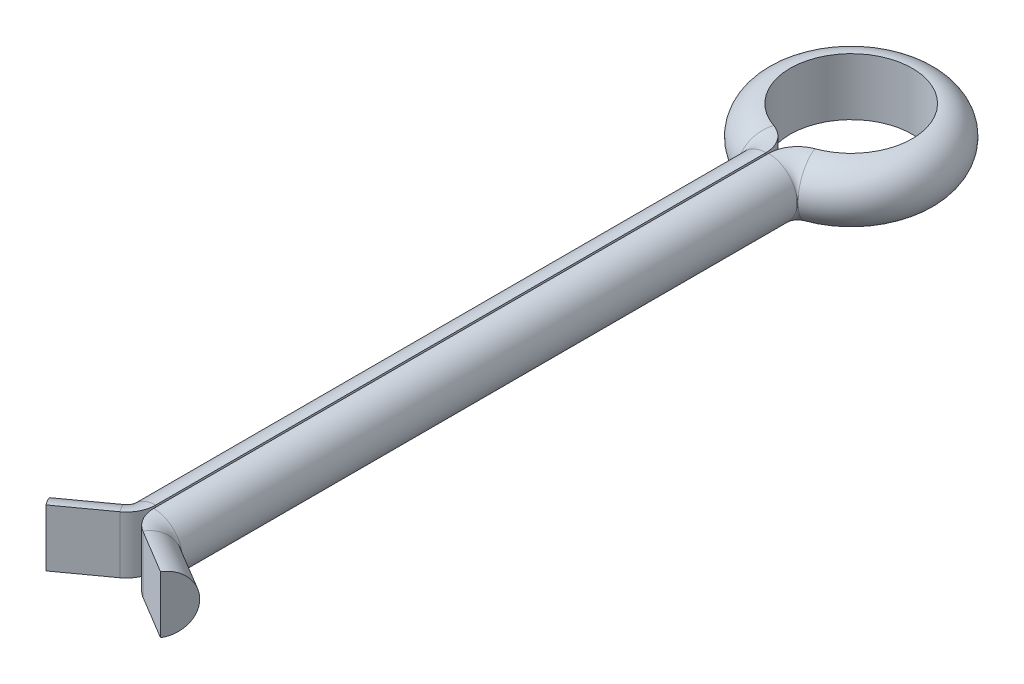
ISO-10303-21;
HEADER;
FILE_DESCRIPTION(('STEP AP214'),'2;1');
FILE_NAME('part.step','',(''),(''),'','','');
FILE_SCHEMA(('AUTOMOTIVE_DESIGN { 1 0 10303 214 1 1 1 1 }'));
ENDSEC;
DATA;
#1=APPLICATION_CONTEXT('core data for automotive mechanical design processes');
#2=APPLICATION_PROTOCOL_DEFINITION('international standard','automotive_design',2000,#1);
#3=PRODUCT_CONTEXT('',#1,'mechanical');
#4=PRODUCT('Part','Part','',(#3));
#5=PRODUCT_RELATED_PRODUCT_CATEGORY('part','',(#4));
#6=PRODUCT_DEFINITION_FORMATION('','',#4);
#7=PRODUCT_DEFINITION_CONTEXT('part definition',#1,'design');
#8=PRODUCT_DEFINITION('design','',#6,#7);
#9=PRODUCT_DEFINITION_SHAPE('','',#8);
#10=(LENGTH_UNIT() NAMED_UNIT(*) SI_UNIT(.MILLI.,.METRE.));
#11=(NAMED_UNIT(*) PLANE_ANGLE_UNIT() SI_UNIT($,.RADIAN.));
#12=(NAMED_UNIT(*) SI_UNIT($,.STERADIAN.) SOLID_ANGLE_UNIT());
#13=UNCERTAINTY_MEASURE_WITH_UNIT(LENGTH_MEASURE(1.E-05),#10,'distance_accuracy_value','');
#14=(GEOMETRIC_REPRESENTATION_CONTEXT(3) GLOBAL_UNCERTAINTY_ASSIGNED_CONTEXT((#13)) GLOBAL_UNIT_ASSIGNED_CONTEXT((#10,
#11,#12)) REPRESENTATION_CONTEXT('',''));
#15=CARTESIAN_POINT('',(0.,0.,0.));
#16=DIRECTION('',(0.,0.,1.));
#17=DIRECTION('',(1.,0.,0.));
#18=AXIS2_PLACEMENT_3D('',#15,#16,#17);
#19=CARTESIAN_POINT('',(-1.24199641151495,2.95,0.898188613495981));
#20=DIRECTION('',(-0.586001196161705,0.,-0.810310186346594));
#21=DIRECTION('',(-0.810310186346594,0.,0.586001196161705));
#22=AXIS2_PLACEMENT_3D('',#19,#20,#21);
#23=PLANE('',#22);
#24=DIRECTION('',(0.,-1.,0.));
#25=VECTOR('',#24,1.);
#26=CARTESIAN_POINT('',(-1.24199641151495,2.95,0.898188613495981));
#27=LINE('',#26,#25);
#28=CARTESIAN_POINT('',(-1.24199641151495,2.95,0.898188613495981));
#29=VERTEX_POINT('',#28);
#30=CARTESIAN_POINT('',(-1.24199641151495,-2.95,0.898188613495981));
#31=VERTEX_POINT('',#30);
#32=EDGE_CURVE('E209',#29,#31,#27,.T.);
#33=ORIENTED_EDGE('',*,*,#32,.F.);
#34=DIRECTION('',(-0.810310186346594,0.,0.586001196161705));
#35=VECTOR('',#34,1.);
#36=CARTESIAN_POINT('',(-1.24199641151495,2.95,0.898188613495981));
#37=LINE('',#36,#35);
#38=CARTESIAN_POINT('',(-5.67217130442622,2.95,4.10200837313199));
#39=VERTEX_POINT('',#38);
#40=EDGE_CURVE('E39',#29,#39,#37,.T.);
#41=ORIENTED_EDGE('',*,*,#40,.T.);
#42=DIRECTION('',(0.,-1.,0.));
#43=VECTOR('',#42,1.);
#44=CARTESIAN_POINT('',(-5.67217130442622,2.95,4.10200837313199));
#45=LINE('',#44,#43);
#46=CARTESIAN_POINT('',(-5.67217130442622,-2.95,4.10200837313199));
#47=VERTEX_POINT('',#46);
#48=EDGE_CURVE('E46',#39,#47,#45,.T.);
#49=ORIENTED_EDGE('',*,*,#48,.T.);
#50=DIRECTION('',(-0.810310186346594,0.,0.586001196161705));
#51=VECTOR('',#50,1.);
#52=CARTESIAN_POINT('',(-1.24199641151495,-2.95,0.898188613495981));
#53=LINE('',#52,#51);
#54=EDGE_CURVE('E11',#31,#47,#53,.T.);
#55=ORIENTED_EDGE('',*,*,#54,.F.);
#56=EDGE_LOOP('',(#33,#41,#49,#55));
#57=FACE_BOUND('',#56,.T.);
#58=ADVANCED_FACE('F32',(#57),#23,.F.);
#59=CARTESIAN_POINT('',(-1.24199641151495,0.,0.898188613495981));
#60=DIRECTION('',(-0.810310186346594,0.,0.586001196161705));
#61=DIRECTION('',(0.586001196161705,0.,0.810310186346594));
#62=AXIS2_PLACEMENT_3D('',#59,#60,#61);
#63=CYLINDRICAL_SURFACE('',#62,2.95);
#64=CARTESIAN_POINT('',(-1.24199641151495,0.,0.898188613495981));
#65=DIRECTION('',(0.810310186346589,0.,-0.586001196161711));
#66=DIRECTION('',(-0.586001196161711,0.,-0.810310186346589));
#67=AXIS2_PLACEMENT_3D('',#64,#65,#66);
#68=CIRCLE('',#67,2.95);
#69=EDGE_CURVE('E206',#31,#29,#68,.T.);
#70=ORIENTED_EDGE('',*,*,#69,.F.);
#71=ORIENTED_EDGE('',*,*,#54,.T.);
#72=CARTESIAN_POINT('',(-5.67217130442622,0.,4.10200837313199));
#73=DIRECTION('',(0.810310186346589,0.,-0.586001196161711));
#74=DIRECTION('',(-0.586001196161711,0.,-0.810310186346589));
#75=AXIS2_PLACEMENT_3D('',#72,#73,#74);
#76=CIRCLE('',#75,2.95);
#77=EDGE_CURVE('E52',#47,#39,#76,.T.);
#78=ORIENTED_EDGE('',*,*,#77,.T.);
#79=ORIENTED_EDGE('',*,*,#40,.F.);
#80=EDGE_LOOP('',(#70,#71,#78,#79));
#81=FACE_BOUND('',#80,.T.);
#82=ADVANCED_FACE('F221',(#81),#63,.T.);
#83=CARTESIAN_POINT('',(-3.,0.,-1.53274194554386));
#84=DIRECTION('',(0.,-1.,0.));
#85=DIRECTION('',(0.,0.,-1.));
#86=AXIS2_PLACEMENT_3D('',#83,#84,#85);
#87=CYLINDRICAL_SURFACE('',#86,3.00000000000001);
#88=DIRECTION('',(0.,-1.,0.));
#89=VECTOR('',#88,1.);
#90=CARTESIAN_POINT('',(0.,2.95,-1.53274194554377));
#91=LINE('',#90,#89);
#92=CARTESIAN_POINT('',(0.,2.95,-1.53274194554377));
#93=VERTEX_POINT('',#92);
#94=CARTESIAN_POINT('',(0.,-2.95,-1.53274194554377));
#95=VERTEX_POINT('',#94);
#96=EDGE_CURVE('E197',#93,#95,#91,.T.);
#97=ORIENTED_EDGE('',*,*,#96,.F.);
#98=CARTESIAN_POINT('',(-3.,2.95,-1.53274194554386));
#99=DIRECTION('',(0.,-1.,0.));
#100=DIRECTION('',(0.,0.,-1.));
#101=AXIS2_PLACEMENT_3D('',#98,#99,#100);
#102=CIRCLE('',#101,3.00000000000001);
#103=EDGE_CURVE('E212',#93,#29,#102,.T.);
#104=ORIENTED_EDGE('',*,*,#103,.T.);
#105=ORIENTED_EDGE('',*,*,#32,.T.);
#106=CARTESIAN_POINT('',(-3.,-2.95,-1.53274194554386));
#107=DIRECTION('',(0.,-1.,0.));
#108=DIRECTION('',(0.,0.,-1.));
#109=AXIS2_PLACEMENT_3D('',#106,#107,#108);
#110=CIRCLE('',#109,3.00000000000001);
#111=EDGE_CURVE('E215',#95,#31,#110,.T.);
#112=ORIENTED_EDGE('',*,*,#111,.F.);
#113=EDGE_LOOP('',(#97,#104,#105,#112));
#114=FACE_BOUND('',#113,.T.);
#115=ADVANCED_FACE('F225',(#114),#87,.T.);
#116=CARTESIAN_POINT('',(-3.,0.,-1.53274194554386));
#117=DIRECTION('',(0.,-1.,0.));
#118=DIRECTION('',(0.,0.,-1.));
#119=AXIS2_PLACEMENT_3D('',#116,#117,#118);
#120=TOROIDAL_SURFACE('',#119,3.00000000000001,2.95);
#121=CARTESIAN_POINT('',(0.,0.,-1.53274194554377));
#122=DIRECTION('',(0.,0.,-1.));
#123=DIRECTION('',(-1.,0.,0.));
#124=AXIS2_PLACEMENT_3D('',#121,#122,#123);
#125=CIRCLE('',#124,2.95);
#126=EDGE_CURVE('E194',#95,#93,#125,.T.);
#127=ORIENTED_EDGE('',*,*,#126,.F.);
#128=ORIENTED_EDGE('',*,*,#111,.T.);
#129=ORIENTED_EDGE('',*,*,#69,.T.);
#130=ORIENTED_EDGE('',*,*,#103,.F.);
#131=EDGE_LOOP('',(#127,#128,#129,#130));
#132=FACE_BOUND('',#131,.T.);
#133=ADVANCED_FACE('F227',(#132),#120,.T.);
#134=CARTESIAN_POINT('',(0.,2.95,-64.4971595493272));
#135=DIRECTION('',(-1.,0.,0.));
#136=DIRECTION('',(0.,0.,1.));
#137=AXIS2_PLACEMENT_3D('',#134,#135,#136);
#138=PLANE('',#137);
#139=DIRECTION('',(0.,-1.,0.));
#140=VECTOR('',#139,1.);
#141=CARTESIAN_POINT('',(0.,2.95,-64.4971595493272));
#142=LINE('',#141,#140);
#143=CARTESIAN_POINT('',(0.,2.95,-64.4971595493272));
#144=VERTEX_POINT('',#143);
#145=CARTESIAN_POINT('',(0.,-2.95,-64.4971595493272));
#146=VERTEX_POINT('',#145);
#147=EDGE_CURVE('E185',#144,#146,#142,.T.);
#148=ORIENTED_EDGE('',*,*,#147,.F.);
#149=DIRECTION('',(0.,0.,1.));
#150=VECTOR('',#149,1.);
#151=CARTESIAN_POINT('',(0.,2.95,-64.4971595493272));
#152=LINE('',#151,#150);
#153=EDGE_CURVE('E200',#144,#93,#152,.T.);
#154=ORIENTED_EDGE('',*,*,#153,.T.);
#155=ORIENTED_EDGE('',*,*,#96,.T.);
#156=DIRECTION('',(0.,0.,1.));
#157=VECTOR('',#156,1.);
#158=CARTESIAN_POINT('',(0.,-2.95,-64.4971595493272));
#159=LINE('',#158,#157);
#160=EDGE_CURVE('E203',#146,#95,#159,.T.);
#161=ORIENTED_EDGE('',*,*,#160,.F.);
#162=EDGE_LOOP('',(#148,#154,#155,#161));
#163=FACE_BOUND('',#162,.T.);
#164=ADVANCED_FACE('F231',(#163),#138,.F.);
#165=CARTESIAN_POINT('',(0.,0.,-64.4971595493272));
#166=DIRECTION('',(0.,0.,1.));
#167=DIRECTION('',(1.,0.,0.));
#168=AXIS2_PLACEMENT_3D('',#165,#166,#167);
#169=CYLINDRICAL_SURFACE('',#168,2.95);
#170=CARTESIAN_POINT('',(0.,0.,-64.4971595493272));
#171=DIRECTION('',(0.,0.,-1.));
#172=DIRECTION('',(-1.,0.,0.));
#173=AXIS2_PLACEMENT_3D('',#170,#171,#172);
#174=CIRCLE('',#173,2.95);
#175=EDGE_CURVE('E182',#146,#144,#174,.T.);
#176=ORIENTED_EDGE('',*,*,#175,.F.);
#177=ORIENTED_EDGE('',*,*,#160,.T.);
#178=ORIENTED_EDGE('',*,*,#126,.T.);
#179=ORIENTED_EDGE('',*,*,#153,.F.);
#180=EDGE_LOOP('',(#176,#177,#178,#179));
#181=FACE_BOUND('',#180,.T.);
#182=ADVANCED_FACE('F233',(#181),#169,.T.);
#183=CARTESIAN_POINT('',(-3.,0.,-64.4971595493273));
#184=DIRECTION('',(0.,-1.,0.));
#185=DIRECTION('',(0.,0.,-1.));
#186=AXIS2_PLACEMENT_3D('',#183,#184,#185);
#187=CYLINDRICAL_SURFACE('',#186,3.00000000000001);
#188=DIRECTION('',(0.,-1.,0.));
#189=VECTOR('',#188,1.);
#190=CARTESIAN_POINT('',(-2.03225806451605,2.95,-67.3367855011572));
#191=LINE('',#190,#189);
#192=CARTESIAN_POINT('',(-2.03225806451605,2.95,-67.3367855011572));
#193=VERTEX_POINT('',#192);
#194=CARTESIAN_POINT('',(-2.03225806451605,-2.95,-67.3367855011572));
#195=VERTEX_POINT('',#194);
#196=EDGE_CURVE('E173',#193,#195,#191,.T.);
#197=ORIENTED_EDGE('',*,*,#196,.F.);
#198=CARTESIAN_POINT('',(-3.,2.95,-64.4971595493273));
#199=DIRECTION('',(0.,-1.,0.));
#200=DIRECTION('',(0.,0.,-1.));
#201=AXIS2_PLACEMENT_3D('',#198,#199,#200);
#202=CIRCLE('',#201,3.00000000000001);
#203=EDGE_CURVE('E188',#193,#144,#202,.T.);
#204=ORIENTED_EDGE('',*,*,#203,.T.);
#205=ORIENTED_EDGE('',*,*,#147,.T.);
#206=CARTESIAN_POINT('',(-3.,-2.95,-64.4971595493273));
#207=DIRECTION('',(0.,-1.,0.));
#208=DIRECTION('',(0.,0.,-1.));
#209=AXIS2_PLACEMENT_3D('',#206,#207,#208);
#210=CIRCLE('',#209,3.00000000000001);
#211=EDGE_CURVE('E191',#195,#146,#210,.T.);
#212=ORIENTED_EDGE('',*,*,#211,.F.);
#213=EDGE_LOOP('',(#197,#204,#205,#212));
#214=FACE_BOUND('',#213,.T.);
#215=ADVANCED_FACE('F237',(#214),#187,.T.);
#216=CARTESIAN_POINT('',(-3.,0.,-64.4971595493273));
#217=DIRECTION('',(0.,-1.,0.));
#218=DIRECTION('',(0.,0.,-1.));
#219=AXIS2_PLACEMENT_3D('',#216,#217,#218);
#220=TOROIDAL_SURFACE('',#219,3.00000000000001,2.95);
#221=CARTESIAN_POINT('',(-2.03225806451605,0.,-67.3367855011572));
#222=DIRECTION('',(-0.946541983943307,0.,-0.322580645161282));
#223=DIRECTION('',(-0.322580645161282,0.,0.946541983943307));
#224=AXIS2_PLACEMENT_3D('',#221,#222,#223);
#225=CIRCLE('',#224,2.95);
#226=EDGE_CURVE('E169',#195,#193,#225,.T.);
#227=ORIENTED_EDGE('',*,*,#226,.F.);
#228=ORIENTED_EDGE('',*,*,#211,.T.);
#229=ORIENTED_EDGE('',*,*,#175,.T.);
#230=ORIENTED_EDGE('',*,*,#203,.F.);
#231=EDGE_LOOP('',(#227,#228,#229,#230));
#232=FACE_BOUND('',#231,.T.);
#233=ADVANCED_FACE('F239',(#232),#220,.T.);
#234=CARTESIAN_POINT('',(0.,0.,-73.3));
#235=DIRECTION('',(0.,1.,0.));
#236=DIRECTION('',(0.,0.,1.));
#237=AXIS2_PLACEMENT_3D('',#234,#235,#236);
#238=CYLINDRICAL_SURFACE('',#237,6.29999999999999);
#239=DIRECTION('',(0.,-1.,0.));
#240=VECTOR('',#239,1.);
#241=CARTESIAN_POINT('',(2.16774193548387,2.95,-67.3846897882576));
#242=LINE('',#241,#240);
#243=CARTESIAN_POINT('',(2.16774193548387,2.95,-67.3846897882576));
#244=VERTEX_POINT('',#243);
#245=CARTESIAN_POINT('',(2.16774193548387,-2.95,-67.3846897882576));
#246=VERTEX_POINT('',#245);
#247=EDGE_CURVE('E160',#244,#246,#242,.T.);
#248=ORIENTED_EDGE('',*,*,#247,.F.);
#249=CARTESIAN_POINT('',(0.,2.95,-73.3));
#250=DIRECTION('',(0.,1.,0.));
#251=DIRECTION('',(0.,0.,1.));
#252=AXIS2_PLACEMENT_3D('',#249,#250,#251);
#253=CIRCLE('',#252,6.29999999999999);
#254=EDGE_CURVE('E176',#244,#193,#253,.T.);
#255=ORIENTED_EDGE('',*,*,#254,.T.);
#256=ORIENTED_EDGE('',*,*,#196,.T.);
#257=CARTESIAN_POINT('',(0.,-2.95,-73.3));
#258=DIRECTION('',(0.,1.,0.));
#259=DIRECTION('',(0.,0.,1.));
#260=AXIS2_PLACEMENT_3D('',#257,#258,#259);
#261=CIRCLE('',#260,6.29999999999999);
#262=EDGE_CURVE('E179',#246,#195,#261,.T.);
#263=ORIENTED_EDGE('',*,*,#262,.F.);
#264=EDGE_LOOP('',(#248,#255,#256,#263));
#265=FACE_BOUND('',#264,.T.);
#266=ADVANCED_FACE('F243',(#265),#238,.F.);
#267=CARTESIAN_POINT('',(0.,0.,-73.3));
#268=DIRECTION('',(0.,1.,0.));
#269=DIRECTION('',(0.,0.,1.));
#270=AXIS2_PLACEMENT_3D('',#267,#268,#269);
#271=TOROIDAL_SURFACE('',#270,6.29999999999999,2.95);
#272=CARTESIAN_POINT('',(2.16774193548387,0.,-67.3846897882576));
#273=DIRECTION('',(-0.938938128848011,0.,0.344086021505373));
#274=DIRECTION('',(0.344086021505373,0.,0.938938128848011));
#275=AXIS2_PLACEMENT_3D('',#272,#273,#274);
#276=CIRCLE('',#275,2.95);
#277=EDGE_CURVE('E157',#246,#244,#276,.T.);
#278=ORIENTED_EDGE('',*,*,#277,.F.);
#279=ORIENTED_EDGE('',*,*,#262,.T.);
#280=ORIENTED_EDGE('',*,*,#226,.T.);
#281=ORIENTED_EDGE('',*,*,#254,.F.);
#282=EDGE_LOOP('',(#278,#279,#280,#281));
#283=FACE_BOUND('',#282,.T.);
#284=ADVANCED_FACE('F245',(#283),#271,.T.);
#285=CARTESIAN_POINT('',(3.2,0.,-64.5678754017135));
#286=DIRECTION('',(0.,-1.,0.));
#287=DIRECTION('',(0.,0.,-1.));
#288=AXIS2_PLACEMENT_3D('',#285,#286,#287);
#289=CYLINDRICAL_SURFACE('',#288,2.99999999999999);
#290=DIRECTION('',(0.,-1.,0.));
#291=VECTOR('',#290,1.);
#292=CARTESIAN_POINT('',(0.200000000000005,2.95,-64.5678754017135));
#293=LINE('',#292,#291);
#294=CARTESIAN_POINT('',(0.200000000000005,2.95,-64.5678754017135));
#295=VERTEX_POINT('',#294);
#296=CARTESIAN_POINT('',(0.200000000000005,-2.95,-64.5678754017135));
#297=VERTEX_POINT('',#296);
#298=EDGE_CURVE('E148',#295,#297,#293,.T.);
#299=ORIENTED_EDGE('',*,*,#298,.F.);
#300=CARTESIAN_POINT('',(3.2,2.95,-64.5678754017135));
#301=DIRECTION('',(0.,-1.,0.));
#302=DIRECTION('',(0.,0.,-1.));
#303=AXIS2_PLACEMENT_3D('',#300,#301,#302);
#304=CIRCLE('',#303,2.99999999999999);
#305=EDGE_CURVE('E163',#295,#244,#304,.T.);
#306=ORIENTED_EDGE('',*,*,#305,.T.);
#307=ORIENTED_EDGE('',*,*,#247,.T.);
#308=CARTESIAN_POINT('',(3.2,-2.95,-64.5678754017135));
#309=DIRECTION('',(0.,-1.,0.));
#310=DIRECTION('',(0.,0.,-1.));
#311=AXIS2_PLACEMENT_3D('',#308,#309,#310);
#312=CIRCLE('',#311,2.99999999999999);
#313=EDGE_CURVE('E166',#297,#246,#312,.T.);
#314=ORIENTED_EDGE('',*,*,#313,.F.);
#315=EDGE_LOOP('',(#299,#306,#307,#314));
#316=FACE_BOUND('',#315,.T.);
#317=ADVANCED_FACE('F249',(#316),#289,.T.);
#318=CARTESIAN_POINT('',(3.2,0.,-64.5678754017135));
#319=DIRECTION('',(0.,-1.,0.));
#320=DIRECTION('',(0.,0.,-1.));
#321=AXIS2_PLACEMENT_3D('',#318,#319,#320);
#322=TOROIDAL_SURFACE('',#321,3.,2.95);
#323=CARTESIAN_POINT('',(0.200000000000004,0.,-64.5678754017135));
#324=DIRECTION('',(0.,0.,1.));
#325=DIRECTION('',(1.,0.,0.));
#326=AXIS2_PLACEMENT_3D('',#323,#324,#325);
#327=CIRCLE('',#326,2.95);
#328=EDGE_CURVE('E144',#297,#295,#327,.T.);
#329=ORIENTED_EDGE('',*,*,#328,.F.);
#330=ORIENTED_EDGE('',*,*,#313,.T.);
#331=ORIENTED_EDGE('',*,*,#277,.T.);
#332=ORIENTED_EDGE('',*,*,#305,.F.);
#333=EDGE_LOOP('',(#329,#330,#331,#332));
#334=FACE_BOUND('',#333,.T.);
#335=ADVANCED_FACE('F251',(#334),#322,.T.);
#336=CARTESIAN_POINT('',(0.200000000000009,2.95,-1.13324821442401));
#337=DIRECTION('',(1.,0.,0.));
#338=DIRECTION('',(0.,0.,-1.));
#339=AXIS2_PLACEMENT_3D('',#336,#337,#338);
#340=PLANE('',#339);
#341=DIRECTION('',(0.,-1.,0.));
#342=VECTOR('',#341,1.);
#343=CARTESIAN_POINT('',(0.200000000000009,2.95,-1.13324821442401));
#344=LINE('',#343,#342);
#345=CARTESIAN_POINT('',(0.200000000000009,2.95,-1.13324821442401));
#346=VERTEX_POINT('',#345);
#347=CARTESIAN_POINT('',(0.200000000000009,-2.95,-1.13324821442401));
#348=VERTEX_POINT('',#347);
#349=EDGE_CURVE('E135',#346,#348,#344,.T.);
#350=ORIENTED_EDGE('',*,*,#349,.F.);
#351=DIRECTION('',(0.,0.,-1.));
#352=VECTOR('',#351,1.);
#353=CARTESIAN_POINT('',(0.200000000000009,2.95,-1.13324821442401));
#354=LINE('',#353,#352);
#355=EDGE_CURVE('E151',#346,#295,#354,.T.);
#356=ORIENTED_EDGE('',*,*,#355,.T.);
#357=ORIENTED_EDGE('',*,*,#298,.T.);
#358=DIRECTION('',(0.,0.,-1.));
#359=VECTOR('',#358,1.);
#360=CARTESIAN_POINT('',(0.200000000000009,-2.95,-1.13324821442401));
#361=LINE('',#360,#359);
#362=EDGE_CURVE('E154',#348,#297,#361,.T.);
#363=ORIENTED_EDGE('',*,*,#362,.F.);
#364=EDGE_LOOP('',(#350,#356,#357,#363));
#365=FACE_BOUND('',#364,.T.);
#366=ADVANCED_FACE('F255',(#365),#340,.F.);
#367=CARTESIAN_POINT('',(0.200000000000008,0.,-1.13324821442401));
#368=DIRECTION('',(0.,0.,-1.));
#369=DIRECTION('',(-1.,0.,0.));
#370=AXIS2_PLACEMENT_3D('',#367,#368,#369);
#371=CYLINDRICAL_SURFACE('',#370,2.95);
#372=CARTESIAN_POINT('',(0.200000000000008,0.,-1.13324821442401));
#373=DIRECTION('',(0.,0.,1.));
#374=DIRECTION('',(1.,0.,0.));
#375=AXIS2_PLACEMENT_3D('',#372,#373,#374);
#376=CIRCLE('',#375,2.95);
#377=EDGE_CURVE('E131',#348,#346,#376,.T.);
#378=ORIENTED_EDGE('',*,*,#377,.F.);
#379=ORIENTED_EDGE('',*,*,#362,.T.);
#380=ORIENTED_EDGE('',*,*,#328,.T.);
#381=ORIENTED_EDGE('',*,*,#355,.F.);
#382=EDGE_LOOP('',(#378,#379,#380,#381));
#383=FACE_BOUND('',#382,.T.);
#384=ADVANCED_FACE('F257',(#383),#371,.T.);
#385=CARTESIAN_POINT('',(3.20000000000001,0.,-1.13324821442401));
#386=DIRECTION('',(0.,-1.,0.));
#387=DIRECTION('',(0.,0.,-1.));
#388=AXIS2_PLACEMENT_3D('',#385,#386,#387);
#389=CYLINDRICAL_SURFACE('',#388,3.);
#390=DIRECTION('',(0.,-1.,0.));
#391=VECTOR('',#390,1.);
#392=CARTESIAN_POINT('',(1.65820256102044,2.95,1.44024370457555));
#393=LINE('',#392,#391);
#394=CARTESIAN_POINT('',(1.65820256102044,2.95,1.44024370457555));
#395=VERTEX_POINT('',#394);
#396=CARTESIAN_POINT('',(1.65820256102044,-2.95,1.44024370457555));
#397=VERTEX_POINT('',#396);
#398=EDGE_CURVE('E120',#395,#397,#393,.T.);
#399=ORIENTED_EDGE('',*,*,#398,.F.);
#400=CARTESIAN_POINT('',(3.20000000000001,2.95,-1.13324821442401));
#401=DIRECTION('',(0.,-1.,0.));
#402=DIRECTION('',(0.,0.,-1.));
#403=AXIS2_PLACEMENT_3D('',#400,#401,#402);
#404=CIRCLE('',#403,3.);
#405=EDGE_CURVE('E138',#395,#346,#404,.T.);
#406=ORIENTED_EDGE('',*,*,#405,.T.);
#407=ORIENTED_EDGE('',*,*,#349,.T.);
#408=CARTESIAN_POINT('',(3.20000000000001,-2.95,-1.13324821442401));
#409=DIRECTION('',(0.,-1.,0.));
#410=DIRECTION('',(0.,0.,-1.));
#411=AXIS2_PLACEMENT_3D('',#408,#409,#410);
#412=CIRCLE('',#411,3.);
#413=EDGE_CURVE('E141',#397,#348,#412,.T.);
#414=ORIENTED_EDGE('',*,*,#413,.F.);
#415=EDGE_LOOP('',(#399,#406,#407,#414));
#416=FACE_BOUND('',#415,.T.);
#417=ADVANCED_FACE('F261',(#416),#389,.T.);
#418=CARTESIAN_POINT('',(3.20000000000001,0.,-1.13324821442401));
#419=DIRECTION('',(0.,-1.,0.));
#420=DIRECTION('',(0.,0.,-1.));
#421=AXIS2_PLACEMENT_3D('',#418,#419,#420);
#422=TOROIDAL_SURFACE('',#421,3.,2.95);
#423=CARTESIAN_POINT('',(1.65820256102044,0.,1.44024370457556));
#424=DIRECTION('',(0.857830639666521,0.,0.513932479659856));
#425=DIRECTION('',(0.513932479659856,0.,-0.857830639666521));
#426=AXIS2_PLACEMENT_3D('',#423,#424,#425);
#427=CIRCLE('',#426,2.95);
#428=EDGE_CURVE('E115',#397,#395,#427,.T.);
#429=ORIENTED_EDGE('',*,*,#428,.F.);
#430=ORIENTED_EDGE('',*,*,#413,.T.);
#431=ORIENTED_EDGE('',*,*,#377,.T.);
#432=ORIENTED_EDGE('',*,*,#405,.F.);
#433=EDGE_LOOP('',(#429,#430,#431,#432));
#434=FACE_BOUND('',#433,.T.);
#435=ADVANCED_FACE('F262',(#434),#422,.T.);
#436=CARTESIAN_POINT('',(1.65820256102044,0.,1.44024370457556));
#437=DIRECTION('',(0.857830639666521,0.,0.513932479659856));
#438=DIRECTION('',(0.513932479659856,0.,-0.857830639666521));
#439=AXIS2_PLACEMENT_3D('',#436,#437,#438);
#440=CYLINDRICAL_SURFACE('',#439,2.95);
#441=CARTESIAN_POINT('',(6.20481447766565,0.,4.164151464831));
#442=DIRECTION('',(0.857830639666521,0.,0.513932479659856));
#443=DIRECTION('',(0.513932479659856,0.,-0.857830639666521));
#444=AXIS2_PLACEMENT_3D('',#441,#442,#443);
#445=CIRCLE('',#444,2.95);
#446=CARTESIAN_POINT('',(6.20481447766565,-2.95,4.164151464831));
#447=VERTEX_POINT('',#446);
#448=CARTESIAN_POINT('',(6.20481447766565,2.95,4.164151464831));
#449=VERTEX_POINT('',#448);
#450=EDGE_CURVE('E112',#447,#449,#445,.T.);
#451=ORIENTED_EDGE('',*,*,#450,.F.);
#452=DIRECTION('',(0.857830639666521,0.,0.513932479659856));
#453=VECTOR('',#452,1.);
#454=CARTESIAN_POINT('',(1.65820256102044,-2.95,1.44024370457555));
#455=LINE('',#454,#453);
#456=EDGE_CURVE('E119',#397,#447,#455,.T.);
#457=ORIENTED_EDGE('',*,*,#456,.F.);
#458=ORIENTED_EDGE('',*,*,#428,.T.);
#459=DIRECTION('',(0.857830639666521,0.,0.513932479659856));
#460=VECTOR('',#459,1.);
#461=CARTESIAN_POINT('',(1.65820256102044,2.95,1.44024370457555));
#462=LINE('',#461,#460);
#463=EDGE_CURVE('E108',#395,#449,#462,.T.);
#464=ORIENTED_EDGE('',*,*,#463,.T.);
#465=EDGE_LOOP('',(#451,#457,#458,#464));
#466=FACE_BOUND('',#465,.T.);
#467=ADVANCED_FACE('F110',(#466),#440,.T.);
#468=CARTESIAN_POINT('',(1.65820256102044,2.95,1.44024370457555));
#469=DIRECTION('',(-0.513932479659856,0.,0.857830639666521));
#470=DIRECTION('',(0.857830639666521,0.,0.513932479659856));
#471=AXIS2_PLACEMENT_3D('',#468,#469,#470);
#472=PLANE('',#471);
#473=DIRECTION('',(0.,-1.,0.));
#474=VECTOR('',#473,1.);
#475=CARTESIAN_POINT('',(6.20481447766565,2.95,4.164151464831));
#476=LINE('',#475,#474);
#477=EDGE_CURVE('E124',#449,#447,#476,.T.);
#478=ORIENTED_EDGE('',*,*,#477,.F.);
#479=ORIENTED_EDGE('',*,*,#463,.F.);
#480=ORIENTED_EDGE('',*,*,#398,.T.);
#481=ORIENTED_EDGE('',*,*,#456,.T.);
#482=EDGE_LOOP('',(#478,#479,#480,#481));
#483=FACE_BOUND('',#482,.T.);
#484=ADVANCED_FACE('F126',(#483),#472,.T.);
#485=CARTESIAN_POINT('',(-5.67217130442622,0.,4.10200837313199));
#486=DIRECTION('',(0.810310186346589,0.,-0.586001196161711));
#487=DIRECTION('',(-0.586001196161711,0.,-0.810310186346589));
#488=AXIS2_PLACEMENT_3D('',#485,#486,#487);
#489=PLANE('',#488);
#490=ORIENTED_EDGE('',*,*,#77,.F.);
#491=ORIENTED_EDGE('',*,*,#48,.F.);
#492=EDGE_LOOP('',(#490,#491));
#493=FACE_BOUND('',#492,.T.);
#494=ADVANCED_FACE('F331',(#493),#489,.F.);
#495=CARTESIAN_POINT('',(6.20481447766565,0.,4.164151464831));
#496=DIRECTION('',(0.857830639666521,0.,0.513932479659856));
#497=DIRECTION('',(0.513932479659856,0.,-0.857830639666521));
#498=AXIS2_PLACEMENT_3D('',#495,#496,#497);
#499=PLANE('',#498);
#500=ORIENTED_EDGE('',*,*,#450,.T.);
#501=ORIENTED_EDGE('',*,*,#477,.T.);
#502=EDGE_LOOP('',(#500,#501));
#503=FACE_BOUND('',#502,.T.);
#504=ADVANCED_FACE('F123',(#503),#499,.T.);
#505=CLOSED_SHELL('',(#58,#82,#115,#133,#164,#182,#215,#233,#266,#284,#317,#335,#366,#384,#417,
#435,#467,#484,#494,#504));
#506=MANIFOLD_SOLID_BREP('B2',#505);
#507=ADVANCED_BREP_SHAPE_REPRESENTATION('',(#18,#506),#14);
#508=SHAPE_DEFINITION_REPRESENTATION(#9,#507);
ENDSEC;
END-ISO-10303-21;
